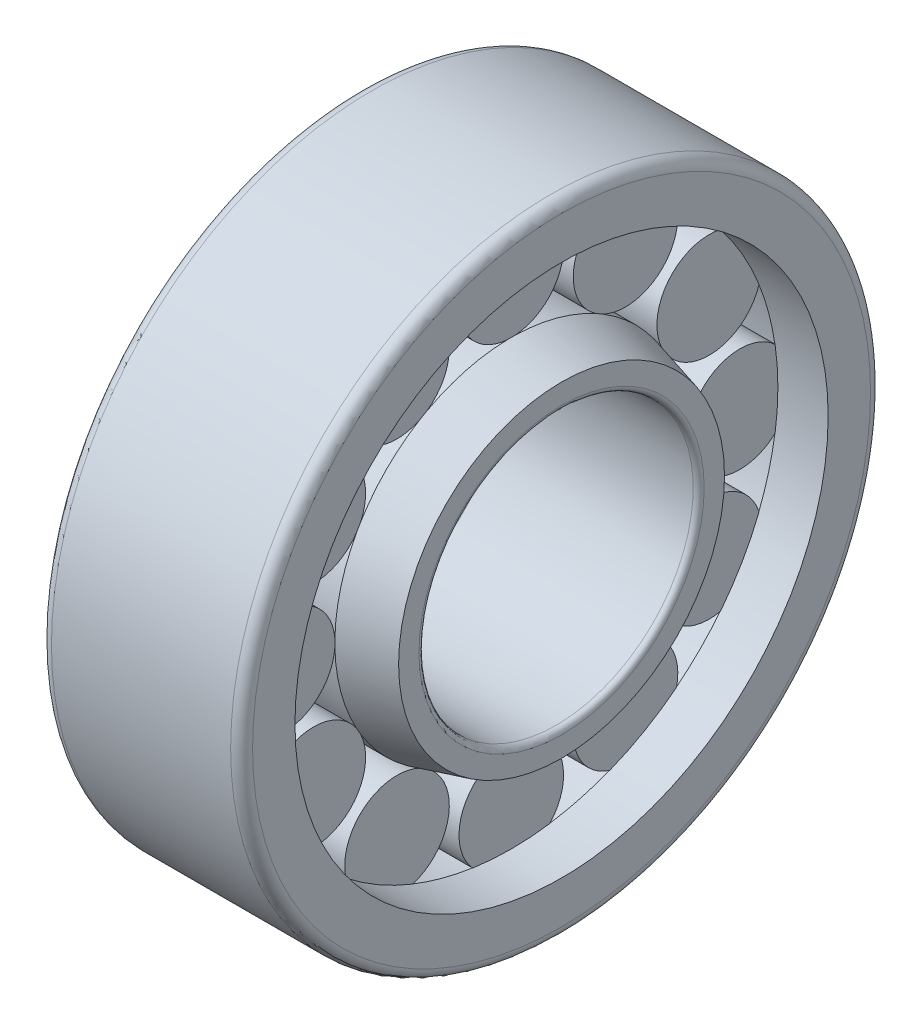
from build123d import *

# Parameters (mm, degrees)
SKETCH2_W               = 5.5
SKETCH2_H               = 2.86
CIRCULAR_PATTERN1_COUNT = 12
FILLET1_R               = 0.6
FILLET2_R               = 0.3


with BuildPart() as part:
    # Sketch1 → Revolve1 (revolve)
    with BuildSketch(Plane.XY, mode=Mode.PRIVATE) as revolve1_sk:
        Polygon((-5.5, 7.5), (5.5, 7.5), (5.5, 8.913139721), (2.75, 9.65), (-2.75, 9.65), (-5.5, 8.913139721), align=None)
    revolve(revolve1_sk.sketch.rotate(Axis((-10.137871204, 0, 0), (1, 0, 0)), 90), axis=Axis((-10.137871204, 0, 0), (1, 0, 0)))

    # Sketch2 → Revolve2 (revolve)
    with BuildSketch(Plane.XY):
        with Locations((0, 11.07)):
            Rectangle(SKETCH2_W, SKETCH2_H)
    revolve2 = revolve(axis=Axis((-7.422783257, 12.5, 0), (1, 0, 0)))

    # Sketch3 → Revolve3 (revolve)
    with BuildSketch(Plane.XY, mode=Mode.PRIVATE) as revolve3_sk:
        Polygon((-5.5, 17.5), (5.5, 17.5), (5.5, 14.5825), (2.74, 14.5825), (2.74, 15.35), (-2.74, 15.35), (-2.74, 14.5825), (-5.5, 14.5825), align=None)
    revolve(revolve3_sk.sketch.rotate(Axis((-9.082213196, 0, 0), (1, 0, 0)), 90), axis=Axis((-9.082213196, 0, 0), (1, 0, 0)))

    # Circular-Pattern1: Revolve2 ×12 about axis
    circular_pattern1_axis = Axis((0, 0, 0), (1, 0, 0))
    for i in range(1, CIRCULAR_PATTERN1_COUNT):
        add(revolve2.rotate(circular_pattern1_axis, i * 360 / CIRCULAR_PATTERN1_COUNT))

    # Fillet1
    fillet1_edges = [part.edges().sort_by_distance(p)[0] for p in [
        (-5.5, 0, -17.5),
        (5.5, 0, -17.5),
    ]]
    fillet(fillet1_edges, radius=FILLET1_R)

    # Fillet2
    fillet2_edges = [part.edges().sort_by_distance(p)[0] for p in [
        (5.5, 0, -7.5),
        (-5.5, 0, -7.5),
    ]]
    fillet(fillet2_edges, radius=FILLET2_R)


solid = part.part
